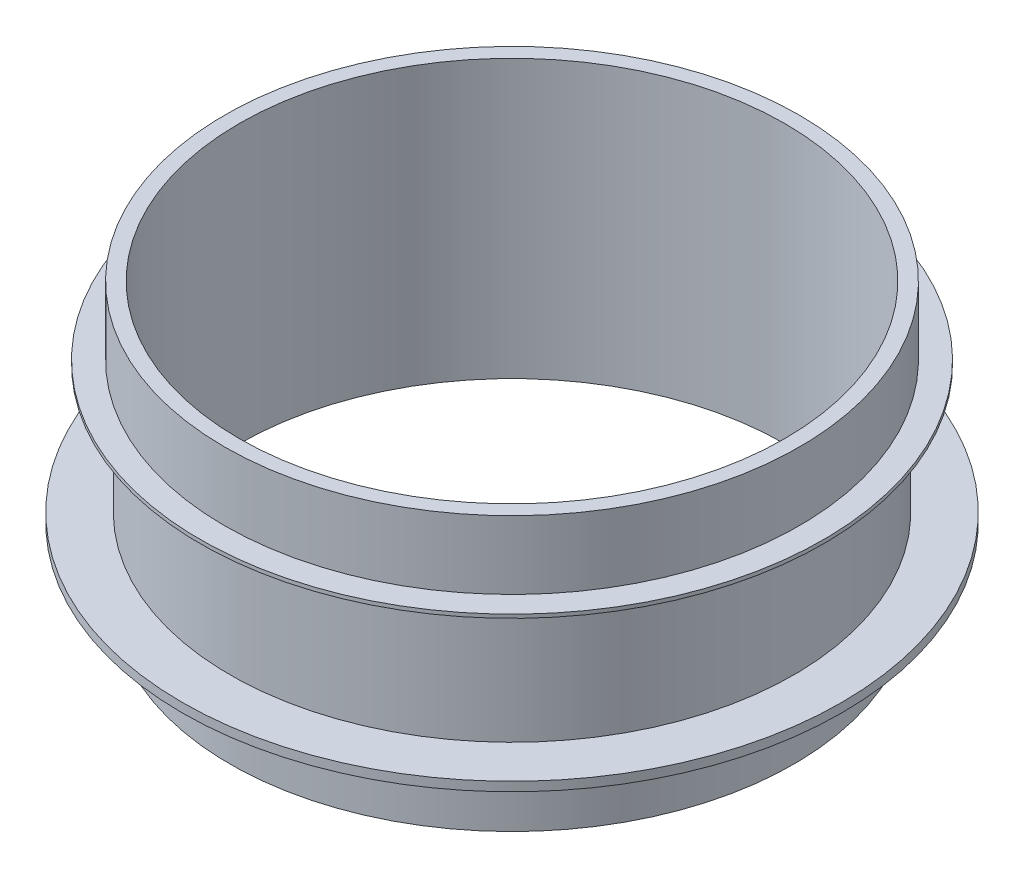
ISO-10303-21;
HEADER;
FILE_DESCRIPTION(('STEP AP214'),'2;1');
FILE_NAME('part.step','',(''),(''),'','','');
FILE_SCHEMA(('AUTOMOTIVE_DESIGN { 1 0 10303 214 1 1 1 1 }'));
ENDSEC;
DATA;
#1=APPLICATION_CONTEXT('core data for automotive mechanical design processes');
#2=APPLICATION_PROTOCOL_DEFINITION('international standard','automotive_design',2000,#1);
#3=PRODUCT_CONTEXT('',#1,'mechanical');
#4=PRODUCT('Part','Part','',(#3));
#5=PRODUCT_RELATED_PRODUCT_CATEGORY('part','',(#4));
#6=PRODUCT_DEFINITION_FORMATION('','',#4);
#7=PRODUCT_DEFINITION_CONTEXT('part definition',#1,'design');
#8=PRODUCT_DEFINITION('design','',#6,#7);
#9=PRODUCT_DEFINITION_SHAPE('','',#8);
#10=(LENGTH_UNIT() NAMED_UNIT(*) SI_UNIT(.MILLI.,.METRE.));
#11=(NAMED_UNIT(*) PLANE_ANGLE_UNIT() SI_UNIT($,.RADIAN.));
#12=(NAMED_UNIT(*) SI_UNIT($,.STERADIAN.) SOLID_ANGLE_UNIT());
#13=UNCERTAINTY_MEASURE_WITH_UNIT(LENGTH_MEASURE(1.E-05),#10,'distance_accuracy_value','');
#14=(GEOMETRIC_REPRESENTATION_CONTEXT(3) GLOBAL_UNCERTAINTY_ASSIGNED_CONTEXT((#13)) GLOBAL_UNIT_ASSIGNED_CONTEXT((#10,
#11,#12)) REPRESENTATION_CONTEXT('',''));
#15=CARTESIAN_POINT('',(0.,0.,0.));
#16=DIRECTION('',(0.,0.,1.));
#17=DIRECTION('',(1.,0.,0.));
#18=AXIS2_PLACEMENT_3D('',#15,#16,#17);
#19=CARTESIAN_POINT('',(0.,45.2,0.));
#20=DIRECTION('',(0.,-1.,0.));
#21=DIRECTION('',(0.,0.,-1.));
#22=AXIS2_PLACEMENT_3D('',#19,#20,#21);
#23=PLANE('',#22);
#24=CARTESIAN_POINT('',(0.,45.2,0.));
#25=DIRECTION('',(0.,-1.,0.));
#26=DIRECTION('',(0.,0.,-1.));
#27=AXIS2_PLACEMENT_3D('',#24,#25,#26);
#28=CIRCLE('',#27,68.5);
#29=CARTESIAN_POINT('',(0.,45.2,-68.5));
#30=VERTEX_POINT('',#29);
#31=EDGE_CURVE('E11',#30,#30,#28,.T.);
#32=ORIENTED_EDGE('',*,*,#31,.T.);
#33=EDGE_LOOP('',(#32));
#34=FACE_BOUND('',#33,.T.);
#35=CARTESIAN_POINT('',(0.,45.2,0.));
#36=DIRECTION('',(0.,-1.,0.));
#37=DIRECTION('',(0.,0.,-1.));
#38=AXIS2_PLACEMENT_3D('',#35,#36,#37);
#39=CIRCLE('',#38,63.2);
#40=CARTESIAN_POINT('',(0.,45.2,-63.2));
#41=VERTEX_POINT('',#40);
#42=EDGE_CURVE('E49',#41,#41,#39,.T.);
#43=ORIENTED_EDGE('',*,*,#42,.F.);
#44=EDGE_LOOP('',(#43));
#45=FACE_BOUND('',#44,.T.);
#46=ADVANCED_FACE('F38',(#34,#45),#23,.T.);
#47=CARTESIAN_POINT('',(0.,46.,0.));
#48=DIRECTION('',(0.,-1.,0.));
#49=DIRECTION('',(0.,0.,-1.));
#50=AXIS2_PLACEMENT_3D('',#47,#48,#49);
#51=PLANE('',#50);
#52=CARTESIAN_POINT('',(0.,46.,0.));
#53=DIRECTION('',(0.,-1.,0.));
#54=DIRECTION('',(0.,0.,-1.));
#55=AXIS2_PLACEMENT_3D('',#52,#53,#54);
#56=CIRCLE('',#55,68.5);
#57=CARTESIAN_POINT('',(0.,46.,-68.5));
#58=VERTEX_POINT('',#57);
#59=EDGE_CURVE('E45',#58,#58,#56,.T.);
#60=ORIENTED_EDGE('',*,*,#59,.F.);
#61=EDGE_LOOP('',(#60));
#62=FACE_BOUND('',#61,.T.);
#63=CARTESIAN_POINT('',(0.,46.,0.));
#64=DIRECTION('',(0.,-1.,0.));
#65=DIRECTION('',(0.,0.,-1.));
#66=AXIS2_PLACEMENT_3D('',#63,#64,#65);
#67=CIRCLE('',#66,63.2);
#68=CARTESIAN_POINT('',(0.,46.,-63.2));
#69=VERTEX_POINT('',#68);
#70=EDGE_CURVE('E53',#69,#69,#67,.T.);
#71=ORIENTED_EDGE('',*,*,#70,.T.);
#72=EDGE_LOOP('',(#71));
#73=FACE_BOUND('',#72,.T.);
#74=ADVANCED_FACE('F59',(#62,#73),#51,.F.);
#75=CARTESIAN_POINT('',(0.,45.2,0.));
#76=DIRECTION('',(0.,1.,0.));
#77=DIRECTION('',(0.,0.,1.));
#78=AXIS2_PLACEMENT_3D('',#75,#76,#77);
#79=CYLINDRICAL_SURFACE('',#78,68.5);
#80=ORIENTED_EDGE('',*,*,#31,.F.);
#81=EDGE_LOOP('',(#80));
#82=FACE_BOUND('',#81,.T.);
#83=ORIENTED_EDGE('',*,*,#59,.T.);
#84=EDGE_LOOP('',(#83));
#85=FACE_BOUND('',#84,.T.);
#86=ADVANCED_FACE('F40',(#82,#85),#79,.T.);
#87=CARTESIAN_POINT('',(0.,45.2,0.));
#88=DIRECTION('',(0.,1.,0.));
#89=DIRECTION('',(0.,0.,1.));
#90=AXIS2_PLACEMENT_3D('',#87,#88,#89);
#91=CYLINDRICAL_SURFACE('',#90,63.2);
#92=ORIENTED_EDGE('',*,*,#42,.T.);
#93=EDGE_LOOP('',(#92));
#94=FACE_BOUND('',#93,.T.);
#95=ORIENTED_EDGE('',*,*,#70,.F.);
#96=EDGE_LOOP('',(#95));
#97=FACE_BOUND('',#96,.T.);
#98=ADVANCED_FACE('F61',(#94,#97),#91,.F.);
#99=CLOSED_SHELL('',(#46,#74,#86,#98));
#100=MANIFOLD_SOLID_BREP('B2',#99);
#101=CARTESIAN_POINT('',(0.,61.,0.));
#102=DIRECTION('',(0.,-1.,0.));
#103=DIRECTION('',(0.,0.,-1.));
#104=AXIS2_PLACEMENT_3D('',#101,#102,#103);
#105=CYLINDRICAL_SURFACE('',#104,62.);
#106=CARTESIAN_POINT('',(0.,17.,0.));
#107=DIRECTION('',(0.,-1.,0.));
#108=DIRECTION('',(0.,0.,-1.));
#109=AXIS2_PLACEMENT_3D('',#106,#107,#108);
#110=CIRCLE('',#109,62.);
#111=CARTESIAN_POINT('',(0.,17.,-62.));
#112=VERTEX_POINT('',#111);
#113=EDGE_CURVE('E103',#112,#112,#110,.T.);
#114=CARTESIAN_POINT('',(0.,46.,0.));
#115=DIRECTION('',(0.,1.,0.));
#116=DIRECTION('',(0.,0.,1.));
#117=AXIS2_PLACEMENT_3D('',#114,#115,#116);
#118=CIRCLE('',#117,62.);
#119=CARTESIAN_POINT('',(0.,46.,-62.));
#120=VERTEX_POINT('',#119);
#121=EDGE_CURVE('E37',#120,#120,#118,.T.);
#122=CARTESIAN_POINT('',(0.,17.,-62.));
#123=CARTESIAN_POINT('',(0.,17.3020833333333,-62.));
#124=CARTESIAN_POINT('',(0.,17.6041666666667,-62.));
#125=CARTESIAN_POINT('',(0.,18.2083333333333,-62.));
#126=CARTESIAN_POINT('',(0.,18.5104166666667,-62.));
#127=CARTESIAN_POINT('',(0.,19.1145833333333,-62.));
#128=CARTESIAN_POINT('',(0.,19.4166666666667,-62.));
#129=CARTESIAN_POINT('',(0.,20.0208333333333,-62.));
#130=CARTESIAN_POINT('',(0.,20.3229166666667,-62.));
#131=CARTESIAN_POINT('',(0.,20.9270833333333,-62.));
#132=CARTESIAN_POINT('',(0.,21.2291666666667,-62.));
#133=CARTESIAN_POINT('',(0.,21.8333333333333,-62.));
#134=CARTESIAN_POINT('',(0.,22.1354166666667,-62.));
#135=CARTESIAN_POINT('',(0.,22.7395833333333,-62.));
#136=CARTESIAN_POINT('',(0.,23.0416666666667,-62.));
#137=CARTESIAN_POINT('',(0.,23.6458333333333,-62.));
#138=CARTESIAN_POINT('',(0.,23.9479166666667,-62.));
#139=CARTESIAN_POINT('',(0.,24.5520833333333,-62.));
#140=CARTESIAN_POINT('',(0.,24.8541666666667,-62.));
#141=CARTESIAN_POINT('',(0.,25.4583333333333,-62.));
#142=CARTESIAN_POINT('',(0.,25.7604166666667,-62.));
#143=CARTESIAN_POINT('',(0.,26.3645833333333,-62.));
#144=CARTESIAN_POINT('',(0.,26.6666666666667,-62.));
#145=CARTESIAN_POINT('',(0.,27.2708333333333,-62.));
#146=CARTESIAN_POINT('',(0.,27.5729166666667,-62.));
#147=CARTESIAN_POINT('',(0.,28.1770833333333,-62.));
#148=CARTESIAN_POINT('',(0.,28.4791666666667,-62.));
#149=CARTESIAN_POINT('',(0.,29.0833333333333,-62.));
#150=CARTESIAN_POINT('',(0.,29.3854166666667,-62.));
#151=CARTESIAN_POINT('',(0.,29.9895833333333,-62.));
#152=CARTESIAN_POINT('',(0.,30.2916666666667,-62.));
#153=CARTESIAN_POINT('',(0.,30.8958333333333,-62.));
#154=CARTESIAN_POINT('',(0.,31.1979166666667,-62.));
#155=CARTESIAN_POINT('',(0.,31.8020833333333,-62.));
#156=CARTESIAN_POINT('',(0.,32.1041666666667,-62.));
#157=CARTESIAN_POINT('',(0.,32.7083333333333,-62.));
#158=CARTESIAN_POINT('',(0.,33.0104166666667,-62.));
#159=CARTESIAN_POINT('',(0.,33.6145833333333,-62.));
#160=CARTESIAN_POINT('',(0.,33.9166666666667,-62.));
#161=CARTESIAN_POINT('',(0.,34.5208333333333,-62.));
#162=CARTESIAN_POINT('',(0.,34.8229166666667,-62.));
#163=CARTESIAN_POINT('',(0.,35.4270833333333,-62.));
#164=CARTESIAN_POINT('',(0.,35.7291666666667,-62.));
#165=CARTESIAN_POINT('',(0.,36.3333333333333,-62.));
#166=CARTESIAN_POINT('',(0.,36.6354166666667,-62.));
#167=CARTESIAN_POINT('',(0.,37.2395833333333,-62.));
#168=CARTESIAN_POINT('',(0.,37.5416666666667,-62.));
#169=CARTESIAN_POINT('',(0.,38.1458333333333,-62.));
#170=CARTESIAN_POINT('',(0.,38.4479166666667,-62.));
#171=CARTESIAN_POINT('',(0.,39.0520833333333,-62.));
#172=CARTESIAN_POINT('',(0.,39.3541666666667,-62.));
#173=CARTESIAN_POINT('',(0.,39.9583333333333,-62.));
#174=CARTESIAN_POINT('',(0.,40.2604166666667,-62.));
#175=CARTESIAN_POINT('',(0.,40.8645833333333,-62.));
#176=CARTESIAN_POINT('',(0.,41.1666666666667,-62.));
#177=CARTESIAN_POINT('',(0.,41.7708333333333,-62.));
#178=CARTESIAN_POINT('',(0.,42.0729166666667,-62.));
#179=CARTESIAN_POINT('',(0.,42.6770833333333,-62.));
#180=CARTESIAN_POINT('',(0.,42.9791666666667,-62.));
#181=CARTESIAN_POINT('',(0.,43.5833333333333,-62.));
#182=CARTESIAN_POINT('',(0.,43.8854166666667,-62.));
#183=CARTESIAN_POINT('',(0.,44.4895833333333,-62.));
#184=CARTESIAN_POINT('',(0.,44.7916666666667,-62.));
#185=CARTESIAN_POINT('',(0.,45.3958333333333,-62.));
#186=CARTESIAN_POINT('',(0.,45.6979166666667,-62.));
#187=CARTESIAN_POINT('',(0.,46.,-62.));
#188=B_SPLINE_CURVE_WITH_KNOTS('',3,(#122,#123,#124,#125,#126,#127,#128,#129,#130,#131,#132,
#133,#134,#135,#136,#137,#138,#139,#140,#141,#142,#143,#144,#145,#146,#147,#148,#149,#150,#151,
#152,#153,#154,#155,#156,#157,#158,#159,#160,#161,#162,#163,#164,#165,#166,#167,#168,#169,#170,
#171,#172,#173,#174,#175,#176,#177,#178,#179,#180,#181,#182,#183,#184,#185,#186,#187),
.UNSPECIFIED.,.F.,.F.,(4,2,2,2,2,2,2,2,2,2,2,2,2,2,2,2,2,2,2,2,2,2,2,2,2,2,2,2,2,2,2,2,4),(0.,
0.906249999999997,1.8125,2.71875,3.625,4.53125,5.4375,6.34375,7.25,8.15625,9.0625,9.96875,
10.875,11.78125,12.6875,13.59375,14.5,15.40625,16.3125,17.21875,18.125,19.03125,19.9375,
20.84375,21.75,22.65625,23.5625,24.46875,25.375,26.28125,27.1875,28.09375,29.),.UNSPECIFIED.);
#189=EDGE_CURVE('BSEAM99',#112,#120,#188,.T.);
#190=ORIENTED_EDGE('',*,*,#113,.F.);
#191=ORIENTED_EDGE('',*,*,#121,.F.);
#192=ORIENTED_EDGE('',*,*,#189,.T.);
#193=ORIENTED_EDGE('',*,*,#189,.F.);
#194=EDGE_LOOP('',(#190,#192,#191,#193));
#195=FACE_BOUND('',#194,.T.);
#196=ADVANCED_FACE('F99',(#195),#105,.T.);
#197=CARTESIAN_POINT('',(0.,61.,0.));
#198=DIRECTION('',(0.,1.,0.));
#199=DIRECTION('',(0.,0.,1.));
#200=AXIS2_PLACEMENT_3D('',#197,#198,#199);
#201=PLANE('',#200);
#202=CARTESIAN_POINT('',(0.,61.,0.));
#203=DIRECTION('',(0.,1.,0.));
#204=DIRECTION('',(0.,0.,1.));
#205=AXIS2_PLACEMENT_3D('',#202,#203,#204);
#206=CIRCLE('',#205,60.);
#207=CARTESIAN_POINT('',(0.,61.,-60.));
#208=VERTEX_POINT('',#207);
#209=EDGE_CURVE('E128',#208,#208,#206,.T.);
#210=ORIENTED_EDGE('',*,*,#209,.F.);
#211=EDGE_LOOP('',(#210));
#212=FACE_BOUND('',#211,.T.);
#213=CARTESIAN_POINT('',(0.,61.,0.));
#214=DIRECTION('',(0.,1.,0.));
#215=DIRECTION('',(0.,0.,1.));
#216=AXIS2_PLACEMENT_3D('',#213,#214,#215);
#217=CIRCLE('',#216,63.2);
#218=CARTESIAN_POINT('',(0.,61.,63.2));
#219=VERTEX_POINT('',#218);
#220=EDGE_CURVE('E192',#219,#219,#217,.T.);
#221=ORIENTED_EDGE('',*,*,#220,.T.);
#222=EDGE_LOOP('',(#221));
#223=FACE_BOUND('',#222,.T.);
#224=ADVANCED_FACE('F137',(#212,#223),#201,.T.);
#225=CARTESIAN_POINT('',(0.,0.,0.));
#226=DIRECTION('',(0.,1.,0.));
#227=DIRECTION('',(0.,0.,1.));
#228=AXIS2_PLACEMENT_3D('',#225,#226,#227);
#229=PLANE('',#228);
#230=CARTESIAN_POINT('',(0.,0.,0.));
#231=DIRECTION('',(0.,1.,0.));
#232=DIRECTION('',(0.,0.,1.));
#233=AXIS2_PLACEMENT_3D('',#230,#231,#232);
#234=CIRCLE('',#233,62.);
#235=CARTESIAN_POINT('',(0.,0.,-62.));
#236=VERTEX_POINT('',#235);
#237=EDGE_CURVE('E111',#236,#236,#234,.T.);
#238=ORIENTED_EDGE('',*,*,#237,.F.);
#239=EDGE_LOOP('',(#238));
#240=FACE_BOUND('',#239,.T.);
#241=CARTESIAN_POINT('',(0.,0.,0.));
#242=DIRECTION('',(0.,1.,0.));
#243=DIRECTION('',(0.,0.,1.));
#244=AXIS2_PLACEMENT_3D('',#241,#242,#243);
#245=CIRCLE('',#244,60.);
#246=CARTESIAN_POINT('',(0.,0.,-60.));
#247=VERTEX_POINT('',#246);
#248=EDGE_CURVE('E125',#247,#247,#245,.T.);
#249=ORIENTED_EDGE('',*,*,#248,.T.);
#250=EDGE_LOOP('',(#249));
#251=FACE_BOUND('',#250,.T.);
#252=ADVANCED_FACE('F134',(#240,#251),#229,.F.);
#253=CARTESIAN_POINT('',(0.,15.,0.));
#254=DIRECTION('',(0.,-1.,0.));
#255=DIRECTION('',(0.,0.,-1.));
#256=AXIS2_PLACEMENT_3D('',#253,#254,#255);
#257=CIRCLE('',#256,62.);
#258=CARTESIAN_POINT('',(0.,15.,-62.));
#259=VERTEX_POINT('',#258);
#260=EDGE_CURVE('E116',#259,#259,#257,.T.);
#261=CARTESIAN_POINT('',(0.,15.,-62.));
#262=CARTESIAN_POINT('',(0.,14.84375,-62.));
#263=CARTESIAN_POINT('',(0.,14.6875,-62.));
#264=CARTESIAN_POINT('',(0.,14.375,-62.));
#265=CARTESIAN_POINT('',(0.,14.21875,-62.));
#266=CARTESIAN_POINT('',(0.,13.90625,-62.));
#267=CARTESIAN_POINT('',(0.,13.75,-62.));
#268=CARTESIAN_POINT('',(0.,13.4375,-62.));
#269=CARTESIAN_POINT('',(0.,13.28125,-62.));
#270=CARTESIAN_POINT('',(0.,12.96875,-62.));
#271=CARTESIAN_POINT('',(0.,12.8125,-62.));
#272=CARTESIAN_POINT('',(0.,12.5,-62.));
#273=CARTESIAN_POINT('',(0.,12.34375,-62.));
#274=CARTESIAN_POINT('',(0.,12.03125,-62.));
#275=CARTESIAN_POINT('',(0.,11.875,-62.));
#276=CARTESIAN_POINT('',(0.,11.5625,-62.));
#277=CARTESIAN_POINT('',(0.,11.40625,-62.));
#278=CARTESIAN_POINT('',(0.,11.09375,-62.));
#279=CARTESIAN_POINT('',(0.,10.9375,-62.));
#280=CARTESIAN_POINT('',(0.,10.625,-62.));
#281=CARTESIAN_POINT('',(0.,10.46875,-62.));
#282=CARTESIAN_POINT('',(0.,10.15625,-62.));
#283=CARTESIAN_POINT('',(0.,10.,-62.));
#284=CARTESIAN_POINT('',(0.,9.6875,-62.));
#285=CARTESIAN_POINT('',(0.,9.53125,-62.));
#286=CARTESIAN_POINT('',(0.,9.21875,-62.));
#287=CARTESIAN_POINT('',(0.,9.0625,-62.));
#288=CARTESIAN_POINT('',(0.,8.75,-62.));
#289=CARTESIAN_POINT('',(0.,8.59375,-62.));
#290=CARTESIAN_POINT('',(0.,8.28125,-62.));
#291=CARTESIAN_POINT('',(0.,8.125,-62.));
#292=CARTESIAN_POINT('',(0.,7.8125,-62.));
#293=CARTESIAN_POINT('',(0.,7.65625,-62.));
#294=CARTESIAN_POINT('',(0.,7.34375,-62.));
#295=CARTESIAN_POINT('',(0.,7.1875,-62.));
#296=CARTESIAN_POINT('',(0.,6.875,-62.));
#297=CARTESIAN_POINT('',(0.,6.71875,-62.));
#298=CARTESIAN_POINT('',(0.,6.40625,-62.));
#299=CARTESIAN_POINT('',(0.,6.25,-62.));
#300=CARTESIAN_POINT('',(0.,5.9375,-62.));
#301=CARTESIAN_POINT('',(0.,5.78125,-62.));
#302=CARTESIAN_POINT('',(0.,5.46875,-62.));
#303=CARTESIAN_POINT('',(0.,5.3125,-62.));
#304=CARTESIAN_POINT('',(0.,4.99999999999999,-62.));
#305=CARTESIAN_POINT('',(0.,4.84375,-62.));
#306=CARTESIAN_POINT('',(0.,4.53125,-62.));
#307=CARTESIAN_POINT('',(0.,4.375,-62.));
#308=CARTESIAN_POINT('',(0.,4.0625,-62.));
#309=CARTESIAN_POINT('',(0.,3.90625,-62.));
#310=CARTESIAN_POINT('',(0.,3.59375,-62.));
#311=CARTESIAN_POINT('',(0.,3.43749999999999,-62.));
#312=CARTESIAN_POINT('',(0.,3.12499999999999,-62.));
#313=CARTESIAN_POINT('',(0.,2.96874999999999,-62.));
#314=CARTESIAN_POINT('',(0.,2.65625,-62.));
#315=CARTESIAN_POINT('',(0.,2.5,-62.));
#316=CARTESIAN_POINT('',(0.,2.1875,-62.));
#317=CARTESIAN_POINT('',(0.,2.03125,-62.));
#318=CARTESIAN_POINT('',(0.,1.71874999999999,-62.));
#319=CARTESIAN_POINT('',(0.,1.56249999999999,-62.));
#320=CARTESIAN_POINT('',(0.,1.24999999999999,-62.));
#321=CARTESIAN_POINT('',(0.,1.09374999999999,-62.));
#322=CARTESIAN_POINT('',(0.,0.781249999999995,-62.));
#323=CARTESIAN_POINT('',(0.,0.624999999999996,-62.));
#324=CARTESIAN_POINT('',(0.,0.312499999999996,-62.));
#325=CARTESIAN_POINT('',(0.,0.156249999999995,-62.));
#326=CARTESIAN_POINT('',(0.,0.,-62.));
#327=B_SPLINE_CURVE_WITH_KNOTS('',3,(#261,#262,#263,#264,#265,#266,#267,#268,#269,#270,#271,
#272,#273,#274,#275,#276,#277,#278,#279,#280,#281,#282,#283,#284,#285,#286,#287,#288,#289,#290,
#291,#292,#293,#294,#295,#296,#297,#298,#299,#300,#301,#302,#303,#304,#305,#306,#307,#308,#309,
#310,#311,#312,#313,#314,#315,#316,#317,#318,#319,#320,#321,#322,#323,#324,#325,#326),
.UNSPECIFIED.,.F.,.F.,(4,2,2,2,2,2,2,2,2,2,2,2,2,2,2,2,2,2,2,2,2,2,2,2,2,2,2,2,2,2,2,2,4),(0.,
0.468750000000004,0.937500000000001,1.40625,1.875,2.34375000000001,2.8125,3.28125,3.75,
4.21875000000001,4.6875,5.15625,5.62500000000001,6.09375000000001,6.56250000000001,7.03125,
7.50000000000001,7.96875000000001,8.43750000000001,8.90625,9.37500000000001,9.84375000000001,
10.3125,10.78125,11.25,11.71875,12.1875,12.65625,13.125,13.59375,14.0625,14.53125,15.),.UNSPECIFIED.);
#328=EDGE_CURVE('BSEAM101',#259,#236,#327,.T.);
#329=ORIENTED_EDGE('',*,*,#260,.T.);
#330=ORIENTED_EDGE('',*,*,#237,.T.);
#331=ORIENTED_EDGE('',*,*,#328,.T.);
#332=ORIENTED_EDGE('',*,*,#328,.F.);
#333=EDGE_LOOP('',(#329,#331,#330,#332));
#334=FACE_BOUND('',#333,.T.);
#335=ADVANCED_FACE('F101',(#334),#105,.T.);
#336=CARTESIAN_POINT('',(0.,61.,0.));
#337=DIRECTION('',(0.,-1.,0.));
#338=DIRECTION('',(0.,0.,-1.));
#339=AXIS2_PLACEMENT_3D('',#336,#337,#338);
#340=CYLINDRICAL_SURFACE('',#339,60.);
#341=CARTESIAN_POINT('',(0.,61.,-60.));
#342=CARTESIAN_POINT('',(0.,60.3645833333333,-60.));
#343=CARTESIAN_POINT('',(0.,59.7291666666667,-60.));
#344=CARTESIAN_POINT('',(0.,58.4583333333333,-60.));
#345=CARTESIAN_POINT('',(0.,57.8229166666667,-60.));
#346=CARTESIAN_POINT('',(0.,56.5520833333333,-60.));
#347=CARTESIAN_POINT('',(0.,55.9166666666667,-60.));
#348=CARTESIAN_POINT('',(0.,54.6458333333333,-60.));
#349=CARTESIAN_POINT('',(0.,54.0104166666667,-60.));
#350=CARTESIAN_POINT('',(0.,52.7395833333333,-60.));
#351=CARTESIAN_POINT('',(0.,52.1041666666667,-60.));
#352=CARTESIAN_POINT('',(0.,50.8333333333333,-60.));
#353=CARTESIAN_POINT('',(0.,50.1979166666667,-60.));
#354=CARTESIAN_POINT('',(0.,48.9270833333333,-60.));
#355=CARTESIAN_POINT('',(0.,48.2916666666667,-60.));
#356=CARTESIAN_POINT('',(0.,47.0208333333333,-60.));
#357=CARTESIAN_POINT('',(0.,46.3854166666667,-60.));
#358=CARTESIAN_POINT('',(0.,45.1145833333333,-60.));
#359=CARTESIAN_POINT('',(0.,44.4791666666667,-60.));
#360=CARTESIAN_POINT('',(0.,43.2083333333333,-60.));
#361=CARTESIAN_POINT('',(0.,42.5729166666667,-60.));
#362=CARTESIAN_POINT('',(0.,41.3020833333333,-60.));
#363=CARTESIAN_POINT('',(0.,40.6666666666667,-60.));
#364=CARTESIAN_POINT('',(0.,39.3958333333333,-60.));
#365=CARTESIAN_POINT('',(0.,38.7604166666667,-60.));
#366=CARTESIAN_POINT('',(0.,37.4895833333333,-60.));
#367=CARTESIAN_POINT('',(0.,36.8541666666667,-60.));
#368=CARTESIAN_POINT('',(0.,35.5833333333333,-60.));
#369=CARTESIAN_POINT('',(0.,34.9479166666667,-60.));
#370=CARTESIAN_POINT('',(0.,33.6770833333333,-60.));
#371=CARTESIAN_POINT('',(0.,33.0416666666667,-60.));
#372=CARTESIAN_POINT('',(0.,31.7708333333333,-60.));
#373=CARTESIAN_POINT('',(0.,31.1354166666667,-60.));
#374=CARTESIAN_POINT('',(0.,29.8645833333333,-60.));
#375=CARTESIAN_POINT('',(0.,29.2291666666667,-60.));
#376=CARTESIAN_POINT('',(0.,27.9583333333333,-60.));
#377=CARTESIAN_POINT('',(0.,27.3229166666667,-60.));
#378=CARTESIAN_POINT('',(0.,26.0520833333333,-60.));
#379=CARTESIAN_POINT('',(0.,25.4166666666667,-60.));
#380=CARTESIAN_POINT('',(0.,24.1458333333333,-60.));
#381=CARTESIAN_POINT('',(0.,23.5104166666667,-60.));
#382=CARTESIAN_POINT('',(0.,22.2395833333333,-60.));
#383=CARTESIAN_POINT('',(0.,21.6041666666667,-60.));
#384=CARTESIAN_POINT('',(0.,20.3333333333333,-60.));
#385=CARTESIAN_POINT('',(0.,19.6979166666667,-60.));
#386=CARTESIAN_POINT('',(0.,18.4270833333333,-60.));
#387=CARTESIAN_POINT('',(0.,17.7916666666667,-60.));
#388=CARTESIAN_POINT('',(0.,16.5208333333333,-60.));
#389=CARTESIAN_POINT('',(0.,15.8854166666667,-60.));
#390=CARTESIAN_POINT('',(0.,14.6145833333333,-60.));
#391=CARTESIAN_POINT('',(0.,13.9791666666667,-60.));
#392=CARTESIAN_POINT('',(0.,12.7083333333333,-60.));
#393=CARTESIAN_POINT('',(0.,12.0729166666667,-60.));
#394=CARTESIAN_POINT('',(0.,10.8020833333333,-60.));
#395=CARTESIAN_POINT('',(0.,10.1666666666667,-60.));
#396=CARTESIAN_POINT('',(0.,8.89583333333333,-60.));
#397=CARTESIAN_POINT('',(0.,8.26041666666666,-60.));
#398=CARTESIAN_POINT('',(0.,6.98958333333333,-60.));
#399=CARTESIAN_POINT('',(0.,6.35416666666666,-60.));
#400=CARTESIAN_POINT('',(0.,5.08333333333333,-60.));
#401=CARTESIAN_POINT('',(0.,4.44791666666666,-60.));
#402=CARTESIAN_POINT('',(0.,3.17708333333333,-60.));
#403=CARTESIAN_POINT('',(0.,2.54166666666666,-60.));
#404=CARTESIAN_POINT('',(0.,1.27083333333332,-60.));
#405=CARTESIAN_POINT('',(0.,0.635416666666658,-60.));
#406=CARTESIAN_POINT('',(0.,0.,-60.));
#407=B_SPLINE_CURVE_WITH_KNOTS('',3,(#341,#342,#343,#344,#345,#346,#347,#348,#349,#350,#351,
#352,#353,#354,#355,#356,#357,#358,#359,#360,#361,#362,#363,#364,#365,#366,#367,#368,#369,#370,
#371,#372,#373,#374,#375,#376,#377,#378,#379,#380,#381,#382,#383,#384,#385,#386,#387,#388,#389,
#390,#391,#392,#393,#394,#395,#396,#397,#398,#399,#400,#401,#402,#403,#404,#405,#406),
.UNSPECIFIED.,.F.,.F.,(4,2,2,2,2,2,2,2,2,2,2,2,2,2,2,2,2,2,2,2,2,2,2,2,2,2,2,2,2,2,2,2,4),(0.,
1.90625000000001,3.8125,5.71875,7.62500000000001,9.53125000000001,11.4375,13.34375,15.25,
17.15625,19.0625,20.96875,22.875,24.78125,26.6875,28.59375,30.5,32.40625,34.3125,36.21875,
38.125,40.03125,41.9375,43.84375,45.75,47.65625,49.5625,51.46875,53.375,55.28125,57.1875,
59.09375,61.),.UNSPECIFIED.);
#408=EDGE_CURVE('BSEAM141',#208,#247,#407,.T.);
#409=ORIENTED_EDGE('',*,*,#209,.T.);
#410=ORIENTED_EDGE('',*,*,#248,.F.);
#411=ORIENTED_EDGE('',*,*,#408,.T.);
#412=ORIENTED_EDGE('',*,*,#408,.F.);
#413=EDGE_LOOP('',(#409,#411,#410,#412));
#414=FACE_BOUND('',#413,.T.);
#415=ADVANCED_FACE('F141',(#414),#340,.F.);
#416=CARTESIAN_POINT('',(0.,17.,0.));
#417=DIRECTION('',(0.,-1.,0.));
#418=DIRECTION('',(0.,0.,-1.));
#419=AXIS2_PLACEMENT_3D('',#416,#417,#418);
#420=CYLINDRICAL_SURFACE('',#419,72.5);
#421=CARTESIAN_POINT('',(0.,17.,0.));
#422=DIRECTION('',(0.,-1.,0.));
#423=DIRECTION('',(0.,0.,-1.));
#424=AXIS2_PLACEMENT_3D('',#421,#422,#423);
#425=CIRCLE('',#424,72.5);
#426=CARTESIAN_POINT('',(0.,17.,-72.5));
#427=VERTEX_POINT('',#426);
#428=EDGE_CURVE('E122',#427,#427,#425,.T.);
#429=ORIENTED_EDGE('',*,*,#428,.T.);
#430=EDGE_LOOP('',(#429));
#431=FACE_BOUND('',#430,.T.);
#432=CARTESIAN_POINT('',(0.,15.,0.));
#433=DIRECTION('',(0.,-1.,0.));
#434=DIRECTION('',(0.,0.,-1.));
#435=AXIS2_PLACEMENT_3D('',#432,#433,#434);
#436=CIRCLE('',#435,72.5);
#437=CARTESIAN_POINT('',(0.,15.,-72.5));
#438=VERTEX_POINT('',#437);
#439=EDGE_CURVE('E119',#438,#438,#436,.T.);
#440=ORIENTED_EDGE('',*,*,#439,.F.);
#441=EDGE_LOOP('',(#440));
#442=FACE_BOUND('',#441,.T.);
#443=ADVANCED_FACE('F143',(#431,#442),#420,.T.);
#444=CARTESIAN_POINT('',(0.,17.,0.));
#445=DIRECTION('',(0.,-1.,0.));
#446=DIRECTION('',(0.,0.,-1.));
#447=AXIS2_PLACEMENT_3D('',#444,#445,#446);
#448=PLANE('',#447);
#449=ORIENTED_EDGE('',*,*,#113,.T.);
#450=EDGE_LOOP('',(#449));
#451=FACE_BOUND('',#450,.T.);
#452=ORIENTED_EDGE('',*,*,#428,.F.);
#453=EDGE_LOOP('',(#452));
#454=FACE_BOUND('',#453,.T.);
#455=ADVANCED_FACE('F150',(#451,#454),#448,.F.);
#456=CARTESIAN_POINT('',(0.,15.,0.));
#457=DIRECTION('',(0.,-1.,0.));
#458=DIRECTION('',(0.,0.,-1.));
#459=AXIS2_PLACEMENT_3D('',#456,#457,#458);
#460=PLANE('',#459);
#461=ORIENTED_EDGE('',*,*,#260,.F.);
#462=EDGE_LOOP('',(#461));
#463=FACE_BOUND('',#462,.T.);
#464=ORIENTED_EDGE('',*,*,#439,.T.);
#465=EDGE_LOOP('',(#464));
#466=FACE_BOUND('',#465,.T.);
#467=ADVANCED_FACE('F165',(#463,#466),#460,.T.);
#468=CARTESIAN_POINT('',(0.,46.,0.));
#469=DIRECTION('',(0.,1.,0.));
#470=DIRECTION('',(0.,0.,1.));
#471=AXIS2_PLACEMENT_3D('',#468,#469,#470);
#472=PLANE('',#471);
#473=CARTESIAN_POINT('',(0.,46.,0.));
#474=DIRECTION('',(0.,1.,0.));
#475=DIRECTION('',(0.,0.,1.));
#476=AXIS2_PLACEMENT_3D('',#473,#474,#475);
#477=CIRCLE('',#476,63.2);
#478=CARTESIAN_POINT('',(0.,46.,63.2));
#479=VERTEX_POINT('',#478);
#480=EDGE_CURVE('E114',#479,#479,#477,.T.);
#481=ORIENTED_EDGE('',*,*,#480,.F.);
#482=EDGE_LOOP('',(#481));
#483=FACE_BOUND('',#482,.T.);
#484=ORIENTED_EDGE('',*,*,#121,.T.);
#485=EDGE_LOOP('',(#484));
#486=FACE_BOUND('',#485,.T.);
#487=ADVANCED_FACE('F172',(#483,#486),#472,.F.);
#488=CARTESIAN_POINT('',(0.,46.,0.));
#489=DIRECTION('',(0.,1.,0.));
#490=DIRECTION('',(0.,0.,1.));
#491=AXIS2_PLACEMENT_3D('',#488,#489,#490);
#492=CYLINDRICAL_SURFACE('',#491,63.2);
#493=ORIENTED_EDGE('',*,*,#480,.T.);
#494=EDGE_LOOP('',(#493));
#495=FACE_BOUND('',#494,.T.);
#496=ORIENTED_EDGE('',*,*,#220,.F.);
#497=EDGE_LOOP('',(#496));
#498=FACE_BOUND('',#497,.T.);
#499=ADVANCED_FACE('F178',(#495,#498),#492,.T.);
#500=CLOSED_SHELL('',(#196,#224,#252,#335,#415,#443,#455,#467,#487,#499));
#501=MANIFOLD_SOLID_BREP('B6',#500);
#502=ADVANCED_BREP_SHAPE_REPRESENTATION('',(#18,#100,#501),#14);
#503=SHAPE_DEFINITION_REPRESENTATION(#9,#502);
ENDSEC;
END-ISO-10303-21;
